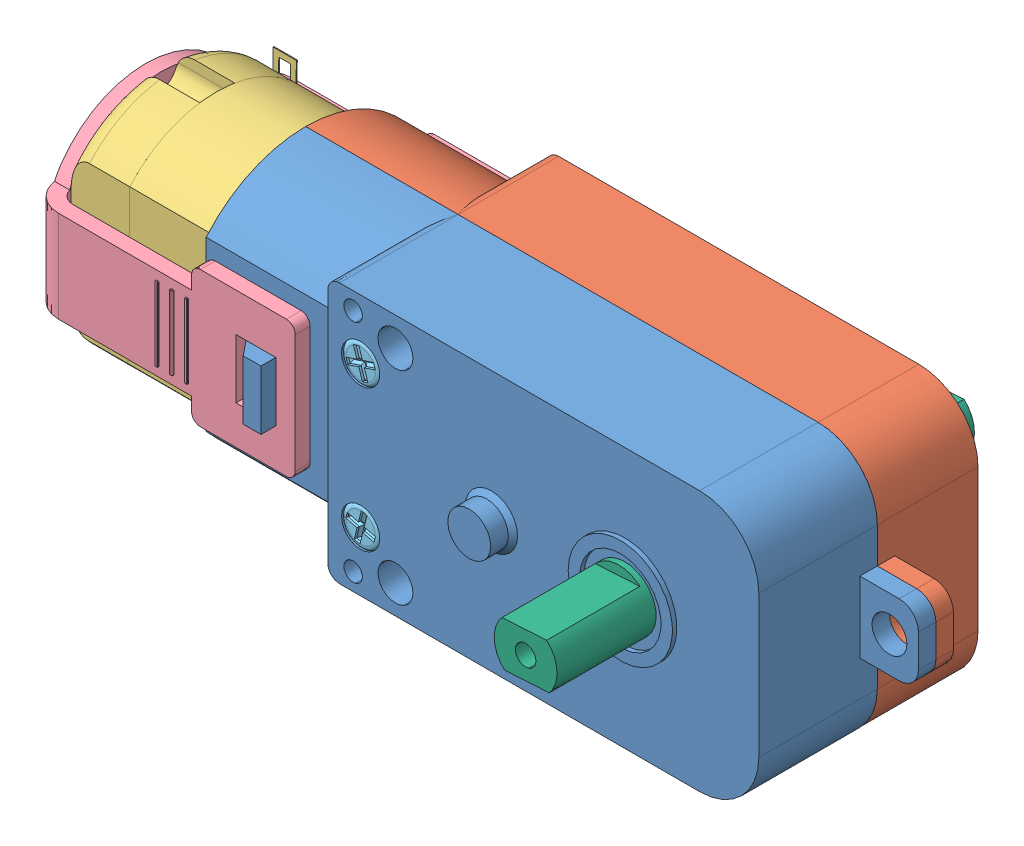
SolidWorks assembly Solarbotics_GM9-Assem.SLDASM, configuration Default (file format 7000). Lengths in mm.
Overall size (70.24 22.35 35.8).
7 component instances, 6 part files, 16 mates.
Components (placement in the parent):
- GM9-driver_side-1: GM9-driver_side.SLDPRT [Default] at origin size (54.05 22.35 12.06)
- GM9-encoder_side-1: GM9-encoder_side.SLDPRT [Default] x (1 0 0) z (0 0 -1) size (54.05 22.35 11.17)
- RM3-regular motor-1: RM3-regular motor.SLDPRT [Default] at (-45.207 -0.0593 0.0007) x (0 0.999923 -0.012377) z (-1 0 0) size (19.88 16.59 37.51)
- GMstrap2-1: GMstrap2.SLDPRT [Default] at (-51.477 -3.937 -10.2616) x (0 0 1) z (1 0 0) size (20.32 17.53 22.86)
- screw_head1-1: screw_head1.SLDPRT [Default] at (-22.6503 6.0833 8.636) x (0.313714 -0.949517 0) z (0 0 1) size (3.5 3.5 1.53)
- screw_head1-2: screw_head1.SLDPRT [Default] at (-22.6503 -6.0833 8.636) x (0.970455 -0.241284 0) z (0 0 1) size (3.5 3.5 1.53)
- output shaft-1: output shaft.SLDPRT [Default] at (0 0 10.16) x (-0.059082 0.998253 0) z (0 0 1) size (5.4 5.4 35.8)
Mates (geometry in assembly coordinates):
- Coincident1: coincident anti-aligned: plane of GM9-driver_side-1 through (11.5 11.176 0) normal (0 0 -1); plane of GM9-encoder_side-1 through (11.5 -11.176 0) normal (0 0 1)
- Coincident2: coincident anti-aligned: line of GM9-driver_side-1 through (6.42 11.176 0) axis (-1 0 0); line of GM9-encoder_side-1 through (-24.457 11.176 0) axis (1 0 0)
- Coincident3: coincident anti-aligned: line of GM9-driver_side-1 through (-25.522 10.046 0) axis (0 -1 0); line of GM9-encoder_side-1 through (-25.522 -10.046 0) axis (0 1 0)
- Concentric2: concentric anti-aligned: cylinder of GM9-driver_side-1 through (-22.6503 6.0833 8.77) axis (0 0 1) radius 1.6404; cylinder of screw_head1-1 through (-22.6503 6.0833 10.16) axis (0 0 -1) radius 1.75
- Coincident7: coincident aligned: plane of GM9-driver_side-1 through (11.5 11.176 10.16) normal (0 0 1); plane of screw_head1-1 through (-22.6503 6.0833 10.16) normal (0 0 1)
- Concentric3: concentric anti-aligned: cylinder of GM9-driver_side-1 through (-22.6503 -6.0833 8.77) axis (0 0 1) radius 1.6404; cylinder of screw_head1-2 through (-22.6503 -6.0833 10.16) axis (0 0 -1) radius 1.75
- Coincident8: coincident aligned: plane of GM9-driver_side-1 through (11.5 11.176 10.16) normal (0 0 1); plane of screw_head1-2 through (-22.6503 -6.0833 10.16) normal (0 0 1)
- Coincident9: coincident anti-aligned: plane of GM9-encoder_side-1 through (-25.522 0 0) normal (-1 0 0); plane of RM3-regular motor-1 through (-25.522 -0.0487 0.0006) normal (1 0 0)
- Concentric4: concentric aligned: cylinder of GM9-driver_side-1 through (-25.522 0 0) axis (-1 0 0) radius 10.046; cylinder of RM3-regular motor-1 through (-25.522 0 0) axis (-1 0 0) radius 9.8911
- Coincident10: coincident: plane of GM9-driver_side-1 through (-25.522 -6.7895 7.4044) normal (0 0 -1); line of RM3-regular motor-1 through (-27.022 6.5581 7.4044) axis (-1 0 0)
- Coincident11: coincident anti-aligned: plane of GM9-driver_side-1 through (-25.457 7.2157 8.5344) normal (0 0 1); plane of GMstrap2-1 through (-37.507 -3.937 8.5344) normal (0 0 -1)
- Coincident12: coincident anti-aligned: plane of RM3-regular motor-1 through (-50.207 -0.0593 0.0007) normal (-1 0 0); plane of GMstrap2-1 through (-50.207 3.937 -10.2616) normal (1 0 0)
- Coincident13: coincident anti-aligned: plane of GM9-driver_side-1 through (-30.283 -2.54 8.5344) normal (0 -1 0); plane of GMstrap2-1 through (-33.697 -2.54 12.8524) normal (0 1 0)
- Coincident14: distance = 0.5 mm aligned: plane of GM9-driver_side-1 through (11.5 11.176 10.16) normal (0 0 1); plane of output shaft-1 through (0 0 10.66) normal (0 0 1)
- Concentric6: concentric aligned: cylinder of GM9-driver_side-1 through (0 0 10.541) axis (0 0 -1) radius 3.4925; cylinder of output shaft-1 through (0 0 10.66) axis (0 0 -1) radius 2.7
- Parallel1: parallel aligned: line of GM9-driver_side-1 through (11.5 -6.096 10.16) axis (0 1 0); line of output shaft-1 through (1.9 -1.9183 18.66) axis (0 1 0)
